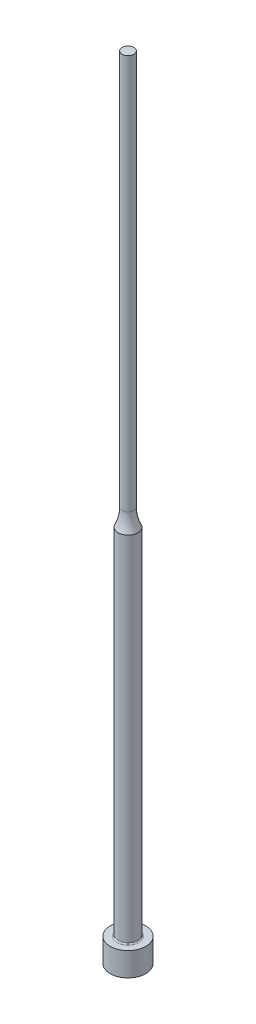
ISO-10303-21;
HEADER;
FILE_DESCRIPTION(('STEP AP214'),'2;1');
FILE_NAME('part.step','',(''),(''),'','','');
FILE_SCHEMA(('AUTOMOTIVE_DESIGN { 1 0 10303 214 1 1 1 1 }'));
ENDSEC;
DATA;
#1=APPLICATION_CONTEXT('core data for automotive mechanical design processes');
#2=APPLICATION_PROTOCOL_DEFINITION('international standard','automotive_design',2000,#1);
#3=PRODUCT_CONTEXT('',#1,'mechanical');
#4=PRODUCT('Part','Part','',(#3));
#5=PRODUCT_RELATED_PRODUCT_CATEGORY('part','',(#4));
#6=PRODUCT_DEFINITION_FORMATION('','',#4);
#7=PRODUCT_DEFINITION_CONTEXT('part definition',#1,'design');
#8=PRODUCT_DEFINITION('design','',#6,#7);
#9=PRODUCT_DEFINITION_SHAPE('','',#8);
#10=(LENGTH_UNIT() NAMED_UNIT(*) SI_UNIT(.MILLI.,.METRE.));
#11=(NAMED_UNIT(*) PLANE_ANGLE_UNIT() SI_UNIT($,.RADIAN.));
#12=(NAMED_UNIT(*) SI_UNIT($,.STERADIAN.) SOLID_ANGLE_UNIT());
#13=UNCERTAINTY_MEASURE_WITH_UNIT(LENGTH_MEASURE(1.E-05),#10,'distance_accuracy_value','');
#14=(GEOMETRIC_REPRESENTATION_CONTEXT(3) GLOBAL_UNCERTAINTY_ASSIGNED_CONTEXT((#13)) GLOBAL_UNIT_ASSIGNED_CONTEXT((#10,
#11,#12)) REPRESENTATION_CONTEXT('',''));
#15=CARTESIAN_POINT('',(0.,0.,0.));
#16=DIRECTION('',(0.,0.,1.));
#17=DIRECTION('',(1.,0.,0.));
#18=AXIS2_PLACEMENT_3D('',#15,#16,#17);
#19=CARTESIAN_POINT('',(1.50000000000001,200.,0.));
#20=DIRECTION('',(0.,-1.,0.));
#21=DIRECTION('',(1.,0.,0.));
#22=AXIS2_PLACEMENT_3D('',#19,#20,#21);
#23=PLANE('',#22);
#24=CARTESIAN_POINT('',(0.,200.,0.));
#25=DIRECTION('',(0.,1.,0.));
#26=DIRECTION('',(-1.,0.,0.));
#27=AXIS2_PLACEMENT_3D('',#24,#25,#26);
#28=CIRCLE('',#27,1.50000000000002);
#29=CARTESIAN_POINT('',(-1.50000000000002,200.,0.));
#30=VERTEX_POINT('',#29);
#31=EDGE_CURVE('E10',#30,#30,#28,.T.);
#32=ORIENTED_EDGE('',*,*,#31,.T.);
#33=EDGE_LOOP('',(#32));
#34=FACE_BOUND('',#33,.T.);
#35=ADVANCED_FACE('F30',(#34),#23,.F.);
#36=CARTESIAN_POINT('',(0.,200.,0.));
#37=DIRECTION('',(0.,1.,0.));
#38=DIRECTION('',(-1.,0.,0.));
#39=AXIS2_PLACEMENT_3D('',#36,#37,#38);
#40=CYLINDRICAL_SURFACE('',#39,1.50000000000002);
#41=ORIENTED_EDGE('',*,*,#31,.F.);
#42=EDGE_LOOP('',(#41));
#43=FACE_BOUND('',#42,.T.);
#44=CARTESIAN_POINT('',(0.,100.,0.));
#45=DIRECTION('',(0.,1.,0.));
#46=DIRECTION('',(-1.,0.,0.));
#47=AXIS2_PLACEMENT_3D('',#44,#45,#46);
#48=CIRCLE('',#47,1.50000000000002);
#49=CARTESIAN_POINT('',(-1.50000000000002,100.,0.));
#50=VERTEX_POINT('',#49);
#51=EDGE_CURVE('E36',#50,#50,#48,.T.);
#52=ORIENTED_EDGE('',*,*,#51,.T.);
#53=EDGE_LOOP('',(#52));
#54=FACE_BOUND('',#53,.T.);
#55=ADVANCED_FACE('F71',(#43,#54),#40,.T.);
#56=CARTESIAN_POINT('',(0.,100.,0.));
#57=DIRECTION('',(0.,1.,0.));
#58=DIRECTION('',(-1.,0.,0.));
#59=AXIS2_PLACEMENT_3D('',#56,#57,#58);
#60=TOROIDAL_SURFACE('',#59,11.5,10.);
#61=ORIENTED_EDGE('',*,*,#51,.F.);
#62=EDGE_LOOP('',(#61));
#63=FACE_BOUND('',#62,.T.);
#64=CARTESIAN_POINT('',(0.,95.6411010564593,0.));
#65=DIRECTION('',(0.,1.,0.));
#66=DIRECTION('',(-1.,0.,0.));
#67=AXIS2_PLACEMENT_3D('',#64,#65,#66);
#68=CIRCLE('',#67,2.50000000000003);
#69=CARTESIAN_POINT('',(-2.50000000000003,95.6411010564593,0.));
#70=VERTEX_POINT('',#69);
#71=EDGE_CURVE('E40',#70,#70,#68,.T.);
#72=ORIENTED_EDGE('',*,*,#71,.T.);
#73=EDGE_LOOP('',(#72));
#74=FACE_BOUND('',#73,.T.);
#75=ADVANCED_FACE('F75',(#63,#74),#60,.F.);
#76=CARTESIAN_POINT('',(0.,200.,0.));
#77=DIRECTION('',(0.,1.,0.));
#78=DIRECTION('',(-1.,0.,0.));
#79=AXIS2_PLACEMENT_3D('',#76,#77,#78);
#80=CYLINDRICAL_SURFACE('',#79,2.50000000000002);
#81=ORIENTED_EDGE('',*,*,#71,.F.);
#82=EDGE_LOOP('',(#81));
#83=FACE_BOUND('',#82,.T.);
#84=CARTESIAN_POINT('',(0.,6.3,0.));
#85=DIRECTION('',(0.,1.,0.));
#86=DIRECTION('',(-1.,0.,0.));
#87=AXIS2_PLACEMENT_3D('',#84,#85,#86);
#88=CIRCLE('',#87,2.50000000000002);
#89=CARTESIAN_POINT('',(-2.50000000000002,6.3,0.));
#90=VERTEX_POINT('',#89);
#91=EDGE_CURVE('E44',#90,#90,#88,.T.);
#92=ORIENTED_EDGE('',*,*,#91,.T.);
#93=EDGE_LOOP('',(#92));
#94=FACE_BOUND('',#93,.T.);
#95=ADVANCED_FACE('F80',(#83,#94),#80,.T.);
#96=CARTESIAN_POINT('',(0.,6.3,0.));
#97=DIRECTION('',(0.,1.,0.));
#98=DIRECTION('',(-1.,0.,0.));
#99=AXIS2_PLACEMENT_3D('',#96,#97,#98);
#100=TOROIDAL_SURFACE('',#99,2.80000000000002,0.3);
#101=ORIENTED_EDGE('',*,*,#91,.F.);
#102=EDGE_LOOP('',(#101));
#103=FACE_BOUND('',#102,.T.);
#104=CARTESIAN_POINT('',(0.,6.00000000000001,0.));
#105=DIRECTION('',(0.,1.,0.));
#106=DIRECTION('',(-1.,0.,0.));
#107=AXIS2_PLACEMENT_3D('',#104,#105,#106);
#108=CIRCLE('',#107,2.80000000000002);
#109=CARTESIAN_POINT('',(-2.80000000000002,6.00000000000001,0.));
#110=VERTEX_POINT('',#109);
#111=EDGE_CURVE('E49',#110,#110,#108,.T.);
#112=ORIENTED_EDGE('',*,*,#111,.T.);
#113=EDGE_LOOP('',(#112));
#114=FACE_BOUND('',#113,.T.);
#115=ADVANCED_FACE('F86',(#103,#114),#100,.F.);
#116=CARTESIAN_POINT('',(4.50000000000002,6.,0.));
#117=DIRECTION('',(0.,-1.,0.));
#118=DIRECTION('',(1.,0.,0.));
#119=AXIS2_PLACEMENT_3D('',#116,#117,#118);
#120=PLANE('',#119);
#121=ORIENTED_EDGE('',*,*,#111,.F.);
#122=EDGE_LOOP('',(#121));
#123=FACE_BOUND('',#122,.T.);
#124=CARTESIAN_POINT('',(0.,6.00000000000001,0.));
#125=DIRECTION('',(0.,1.,0.));
#126=DIRECTION('',(-1.,0.,0.));
#127=AXIS2_PLACEMENT_3D('',#124,#125,#126);
#128=CIRCLE('',#127,4.50000000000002);
#129=CARTESIAN_POINT('',(-4.50000000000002,6.00000000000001,0.));
#130=VERTEX_POINT('',#129);
#131=EDGE_CURVE('E52',#130,#130,#128,.T.);
#132=ORIENTED_EDGE('',*,*,#131,.T.);
#133=EDGE_LOOP('',(#132));
#134=FACE_BOUND('',#133,.T.);
#135=ADVANCED_FACE('F67',(#123,#134),#120,.F.);
#136=CARTESIAN_POINT('',(0.,200.,0.));
#137=DIRECTION('',(0.,1.,0.));
#138=DIRECTION('',(-1.,0.,0.));
#139=AXIS2_PLACEMENT_3D('',#136,#137,#138);
#140=CYLINDRICAL_SURFACE('',#139,4.50000000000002);
#141=ORIENTED_EDGE('',*,*,#131,.F.);
#142=EDGE_LOOP('',(#141));
#143=FACE_BOUND('',#142,.T.);
#144=CARTESIAN_POINT('',(0.,0.,0.));
#145=DIRECTION('',(0.,1.,0.));
#146=DIRECTION('',(-1.,0.,0.));
#147=AXIS2_PLACEMENT_3D('',#144,#145,#146);
#148=CIRCLE('',#147,4.50000000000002);
#149=CARTESIAN_POINT('',(-4.50000000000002,0.,0.));
#150=VERTEX_POINT('',#149);
#151=EDGE_CURVE('E55',#150,#150,#148,.T.);
#152=ORIENTED_EDGE('',*,*,#151,.T.);
#153=EDGE_LOOP('',(#152));
#154=FACE_BOUND('',#153,.T.);
#155=ADVANCED_FACE('F59',(#143,#154),#140,.T.);
#156=CARTESIAN_POINT('',(0.,0.,0.));
#157=DIRECTION('',(0.,1.,0.));
#158=DIRECTION('',(-1.,0.,0.));
#159=AXIS2_PLACEMENT_3D('',#156,#157,#158);
#160=PLANE('',#159);
#161=ORIENTED_EDGE('',*,*,#151,.F.);
#162=EDGE_LOOP('',(#161));
#163=FACE_BOUND('',#162,.T.);
#164=ADVANCED_FACE('F61',(#163),#160,.F.);
#165=CLOSED_SHELL('',(#35,#55,#75,#95,#115,#135,#155,#164));
#166=MANIFOLD_SOLID_BREP('B2',#165);
#167=ADVANCED_BREP_SHAPE_REPRESENTATION('',(#18,#166),#14);
#168=SHAPE_DEFINITION_REPRESENTATION(#9,#167);
ENDSEC;
END-ISO-10303-21;
